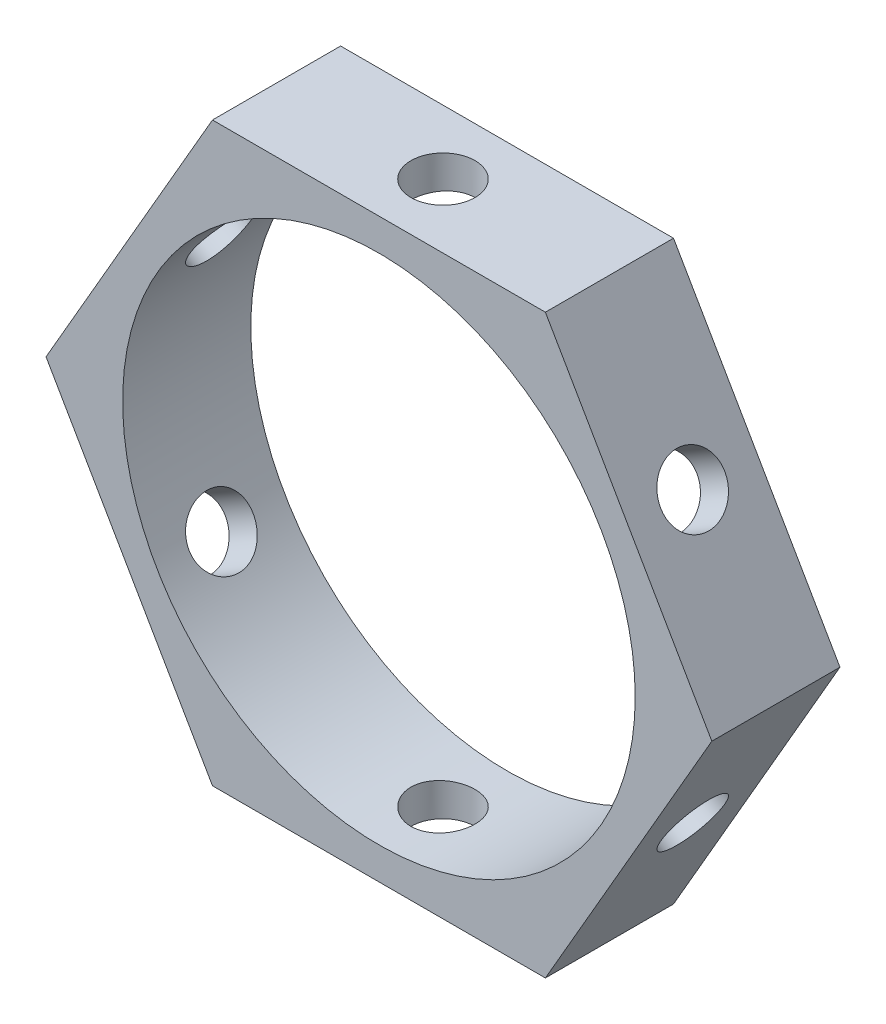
ISO-10303-21;
HEADER;
FILE_DESCRIPTION(('STEP AP214'),'2;1');
FILE_NAME('part.step','',(''),(''),'','','');
FILE_SCHEMA(('AUTOMOTIVE_DESIGN { 1 0 10303 214 1 1 1 1 }'));
ENDSEC;
DATA;
#1=APPLICATION_CONTEXT('core data for automotive mechanical design processes');
#2=APPLICATION_PROTOCOL_DEFINITION('international standard','automotive_design',2000,#1);
#3=PRODUCT_CONTEXT('',#1,'mechanical');
#4=PRODUCT('Part','Part','',(#3));
#5=PRODUCT_RELATED_PRODUCT_CATEGORY('part','',(#4));
#6=PRODUCT_DEFINITION_FORMATION('','',#4);
#7=PRODUCT_DEFINITION_CONTEXT('part definition',#1,'design');
#8=PRODUCT_DEFINITION('design','',#6,#7);
#9=PRODUCT_DEFINITION_SHAPE('','',#8);
#10=(LENGTH_UNIT() NAMED_UNIT(*) SI_UNIT(.MILLI.,.METRE.));
#11=(NAMED_UNIT(*) PLANE_ANGLE_UNIT() SI_UNIT($,.RADIAN.));
#12=(NAMED_UNIT(*) SI_UNIT($,.STERADIAN.) SOLID_ANGLE_UNIT());
#13=UNCERTAINTY_MEASURE_WITH_UNIT(LENGTH_MEASURE(1.E-05),#10,'distance_accuracy_value','');
#14=(GEOMETRIC_REPRESENTATION_CONTEXT(3) GLOBAL_UNCERTAINTY_ASSIGNED_CONTEXT((#13)) GLOBAL_UNIT_ASSIGNED_CONTEXT((#10,
#11,#12)) REPRESENTATION_CONTEXT('',''));
#15=CARTESIAN_POINT('',(0.,0.,0.));
#16=DIRECTION('',(0.,0.,1.));
#17=DIRECTION('',(1.,0.,0.));
#18=AXIS2_PLACEMENT_3D('',#15,#16,#17);
#19=CARTESIAN_POINT('',(12.9903810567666,-22.5,10.));
#20=DIRECTION('',(0.,0.,-1.));
#21=DIRECTION('',(-1.,0.,0.));
#22=AXIS2_PLACEMENT_3D('',#19,#20,#21);
#23=PLANE('',#22);
#24=DIRECTION('',(0.5,0.866025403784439,0.));
#25=VECTOR('',#24,1.);
#26=CARTESIAN_POINT('',(12.9903810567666,-22.5,10.));
#27=LINE('',#26,#25);
#28=CARTESIAN_POINT('',(12.9903810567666,-22.5,10.));
#29=VERTEX_POINT('',#28);
#30=CARTESIAN_POINT('',(25.9807621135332,0.,10.));
#31=VERTEX_POINT('',#30);
#32=EDGE_CURVE('E442',#29,#31,#27,.T.);
#33=ORIENTED_EDGE('',*,*,#32,.T.);
#34=DIRECTION('',(-0.5,0.866025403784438,0.));
#35=VECTOR('',#34,1.);
#36=CARTESIAN_POINT('',(25.9807621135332,0.,10.));
#37=LINE('',#36,#35);
#38=CARTESIAN_POINT('',(12.9903810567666,22.5,10.));
#39=VERTEX_POINT('',#38);
#40=EDGE_CURVE('E423',#31,#39,#37,.T.);
#41=ORIENTED_EDGE('',*,*,#40,.T.);
#42=DIRECTION('',(-1.,0.,0.));
#43=VECTOR('',#42,1.);
#44=CARTESIAN_POINT('',(12.9903810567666,22.5,10.));
#45=LINE('',#44,#43);
#46=CARTESIAN_POINT('',(-12.9903810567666,22.5,10.));
#47=VERTEX_POINT('',#46);
#48=EDGE_CURVE('E445',#39,#47,#45,.T.);
#49=ORIENTED_EDGE('',*,*,#48,.T.);
#50=DIRECTION('',(-0.5,-0.866025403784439,0.));
#51=VECTOR('',#50,1.);
#52=CARTESIAN_POINT('',(-12.9903810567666,22.5,10.));
#53=LINE('',#52,#51);
#54=CARTESIAN_POINT('',(-25.9807621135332,0.,10.));
#55=VERTEX_POINT('',#54);
#56=EDGE_CURVE('E447',#47,#55,#53,.T.);
#57=ORIENTED_EDGE('',*,*,#56,.T.);
#58=DIRECTION('',(0.5,-0.866025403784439,0.));
#59=VECTOR('',#58,1.);
#60=CARTESIAN_POINT('',(-25.9807621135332,0.,10.));
#61=LINE('',#60,#59);
#62=CARTESIAN_POINT('',(-12.9903810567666,-22.5,10.));
#63=VERTEX_POINT('',#62);
#64=EDGE_CURVE('E376',#55,#63,#61,.T.);
#65=ORIENTED_EDGE('',*,*,#64,.T.);
#66=DIRECTION('',(1.,0.,0.));
#67=VECTOR('',#66,1.);
#68=CARTESIAN_POINT('',(-12.9903810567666,-22.5,10.));
#69=LINE('',#68,#67);
#70=EDGE_CURVE('E371',#63,#29,#69,.T.);
#71=ORIENTED_EDGE('',*,*,#70,.T.);
#72=EDGE_LOOP('',(#33,#41,#49,#57,#65,#71));
#73=FACE_BOUND('',#72,.T.);
#74=CARTESIAN_POINT('',(0.,0.,10.));
#75=DIRECTION('',(0.,0.,1.));
#76=DIRECTION('',(1.,0.,0.));
#77=AXIS2_PLACEMENT_3D('',#74,#75,#76);
#78=CIRCLE('',#77,20.);
#79=CARTESIAN_POINT('',(20.,0.,10.));
#80=VERTEX_POINT('',#79);
#81=EDGE_CURVE('E428',#80,#80,#78,.T.);
#82=ORIENTED_EDGE('',*,*,#81,.F.);
#83=EDGE_LOOP('',(#82));
#84=FACE_BOUND('',#83,.T.);
#85=ADVANCED_FACE('F350',(#73,#84),#23,.F.);
#86=CARTESIAN_POINT('',(12.9903810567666,-22.5,0.));
#87=DIRECTION('',(0.,0.,-1.));
#88=DIRECTION('',(-1.,0.,0.));
#89=AXIS2_PLACEMENT_3D('',#86,#87,#88);
#90=PLANE('',#89);
#91=DIRECTION('',(0.5,0.866025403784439,0.));
#92=VECTOR('',#91,1.);
#93=CARTESIAN_POINT('',(12.9903810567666,-22.5,0.));
#94=LINE('',#93,#92);
#95=CARTESIAN_POINT('',(12.9903810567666,-22.5,0.));
#96=VERTEX_POINT('',#95);
#97=CARTESIAN_POINT('',(25.9807621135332,0.,0.));
#98=VERTEX_POINT('',#97);
#99=EDGE_CURVE('E414',#96,#98,#94,.T.);
#100=ORIENTED_EDGE('',*,*,#99,.F.);
#101=DIRECTION('',(1.,0.,0.));
#102=VECTOR('',#101,1.);
#103=CARTESIAN_POINT('',(-12.9903810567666,-22.5,0.));
#104=LINE('',#103,#102);
#105=CARTESIAN_POINT('',(-12.9903810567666,-22.5,0.));
#106=VERTEX_POINT('',#105);
#107=EDGE_CURVE('E440',#106,#96,#104,.T.);
#108=ORIENTED_EDGE('',*,*,#107,.F.);
#109=DIRECTION('',(0.5,-0.866025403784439,0.));
#110=VECTOR('',#109,1.);
#111=CARTESIAN_POINT('',(-25.9807621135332,0.,0.));
#112=LINE('',#111,#110);
#113=CARTESIAN_POINT('',(-25.9807621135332,0.,0.));
#114=VERTEX_POINT('',#113);
#115=EDGE_CURVE('E438',#114,#106,#112,.T.);
#116=ORIENTED_EDGE('',*,*,#115,.F.);
#117=DIRECTION('',(-0.5,-0.866025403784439,0.));
#118=VECTOR('',#117,1.);
#119=CARTESIAN_POINT('',(-12.9903810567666,22.5,0.));
#120=LINE('',#119,#118);
#121=CARTESIAN_POINT('',(-12.9903810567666,22.5,0.));
#122=VERTEX_POINT('',#121);
#123=EDGE_CURVE('E436',#122,#114,#120,.T.);
#124=ORIENTED_EDGE('',*,*,#123,.F.);
#125=DIRECTION('',(-1.,0.,0.));
#126=VECTOR('',#125,1.);
#127=CARTESIAN_POINT('',(12.9903810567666,22.5,0.));
#128=LINE('',#127,#126);
#129=CARTESIAN_POINT('',(12.9903810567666,22.5,0.));
#130=VERTEX_POINT('',#129);
#131=EDGE_CURVE('E416',#130,#122,#128,.T.);
#132=ORIENTED_EDGE('',*,*,#131,.F.);
#133=DIRECTION('',(-0.5,0.866025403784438,0.));
#134=VECTOR('',#133,1.);
#135=CARTESIAN_POINT('',(25.9807621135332,0.,0.));
#136=LINE('',#135,#134);
#137=EDGE_CURVE('E409',#98,#130,#136,.T.);
#138=ORIENTED_EDGE('',*,*,#137,.F.);
#139=EDGE_LOOP('',(#100,#108,#116,#124,#132,#138));
#140=FACE_BOUND('',#139,.T.);
#141=CARTESIAN_POINT('',(0.,0.,0.));
#142=DIRECTION('',(0.,0.,1.));
#143=DIRECTION('',(1.,0.,0.));
#144=AXIS2_PLACEMENT_3D('',#141,#142,#143);
#145=CIRCLE('',#144,20.);
#146=CARTESIAN_POINT('',(20.,0.,0.));
#147=VERTEX_POINT('',#146);
#148=EDGE_CURVE('E431',#147,#147,#145,.T.);
#149=ORIENTED_EDGE('',*,*,#148,.T.);
#150=EDGE_LOOP('',(#149));
#151=FACE_BOUND('',#150,.T.);
#152=ADVANCED_FACE('F410',(#140,#151),#90,.T.);
#153=CARTESIAN_POINT('',(12.9903810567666,-22.5,10.));
#154=DIRECTION('',(-0.866025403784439,0.5,0.));
#155=DIRECTION('',(-0.5,-0.866025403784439,0.));
#156=AXIS2_PLACEMENT_3D('',#153,#154,#155);
#157=PLANE('',#156);
#158=CARTESIAN_POINT('',(19.4855715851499,-11.25,5.));
#159=DIRECTION('',(0.866025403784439,-0.5,0.));
#160=DIRECTION('',(0.5,0.866025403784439,0.));
#161=AXIS2_PLACEMENT_3D('',#158,#159,#160);
#162=CIRCLE('',#161,2.5);
#163=CARTESIAN_POINT('',(20.7355715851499,-9.08493649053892,5.));
#164=VERTEX_POINT('',#163);
#165=EDGE_CURVE('E503',#164,#164,#162,.T.);
#166=ORIENTED_EDGE('',*,*,#165,.F.);
#167=EDGE_LOOP('',(#166));
#168=FACE_BOUND('',#167,.T.);
#169=ORIENTED_EDGE('',*,*,#99,.T.);
#170=DIRECTION('',(0.,0.,-1.));
#171=VECTOR('',#170,1.);
#172=CARTESIAN_POINT('',(25.9807621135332,0.,10.));
#173=LINE('',#172,#171);
#174=EDGE_CURVE('E11',#31,#98,#173,.T.);
#175=ORIENTED_EDGE('',*,*,#174,.F.);
#176=ORIENTED_EDGE('',*,*,#32,.F.);
#177=DIRECTION('',(0.,0.,-1.));
#178=VECTOR('',#177,1.);
#179=CARTESIAN_POINT('',(12.9903810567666,-22.5,10.));
#180=LINE('',#179,#178);
#181=EDGE_CURVE('E427',#29,#96,#180,.T.);
#182=ORIENTED_EDGE('',*,*,#181,.T.);
#183=EDGE_LOOP('',(#169,#175,#176,#182));
#184=FACE_BOUND('',#183,.T.);
#185=ADVANCED_FACE('F352',(#168,#184),#157,.F.);
#186=CARTESIAN_POINT('',(25.9807621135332,0.,10.));
#187=DIRECTION('',(-0.866025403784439,-0.5,0.));
#188=DIRECTION('',(0.5,-0.866025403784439,0.));
#189=AXIS2_PLACEMENT_3D('',#186,#187,#188);
#190=PLANE('',#189);
#191=CARTESIAN_POINT('',(19.4855715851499,11.25,5.));
#192=DIRECTION('',(0.866025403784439,0.5,0.));
#193=DIRECTION('',(-0.5,0.866025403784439,0.));
#194=AXIS2_PLACEMENT_3D('',#191,#192,#193);
#195=CIRCLE('',#194,2.5);
#196=CARTESIAN_POINT('',(18.2355715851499,13.4150635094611,5.));
#197=VERTEX_POINT('',#196);
#198=EDGE_CURVE('E469',#197,#197,#195,.T.);
#199=ORIENTED_EDGE('',*,*,#198,.F.);
#200=EDGE_LOOP('',(#199));
#201=FACE_BOUND('',#200,.T.);
#202=ORIENTED_EDGE('',*,*,#137,.T.);
#203=DIRECTION('',(0.,0.,-1.));
#204=VECTOR('',#203,1.);
#205=CARTESIAN_POINT('',(12.9903810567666,22.5,10.));
#206=LINE('',#205,#204);
#207=EDGE_CURVE('E363',#39,#130,#206,.T.);
#208=ORIENTED_EDGE('',*,*,#207,.F.);
#209=ORIENTED_EDGE('',*,*,#40,.F.);
#210=ORIENTED_EDGE('',*,*,#174,.T.);
#211=EDGE_LOOP('',(#202,#208,#209,#210));
#212=FACE_BOUND('',#211,.T.);
#213=ADVANCED_FACE('F422',(#201,#212),#190,.F.);
#214=CARTESIAN_POINT('',(12.9903810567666,22.5,10.));
#215=DIRECTION('',(0.,-1.,0.));
#216=DIRECTION('',(1.,0.,0.));
#217=AXIS2_PLACEMENT_3D('',#214,#215,#216);
#218=PLANE('',#217);
#219=CARTESIAN_POINT('',(0.,22.5,5.));
#220=DIRECTION('',(0.,-1.,0.));
#221=DIRECTION('',(0.,0.,-1.));
#222=AXIS2_PLACEMENT_3D('',#219,#220,#221);
#223=CIRCLE('',#222,2.5);
#224=CARTESIAN_POINT('',(0.,22.5,2.5));
#225=VERTEX_POINT('',#224);
#226=EDGE_CURVE('E518',#225,#225,#223,.T.);
#227=ORIENTED_EDGE('',*,*,#226,.T.);
#228=EDGE_LOOP('',(#227));
#229=FACE_BOUND('',#228,.T.);
#230=ORIENTED_EDGE('',*,*,#131,.T.);
#231=DIRECTION('',(0.,0.,-1.));
#232=VECTOR('',#231,1.);
#233=CARTESIAN_POINT('',(-12.9903810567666,22.5,10.));
#234=LINE('',#233,#232);
#235=EDGE_CURVE('E458',#47,#122,#234,.T.);
#236=ORIENTED_EDGE('',*,*,#235,.F.);
#237=ORIENTED_EDGE('',*,*,#48,.F.);
#238=ORIENTED_EDGE('',*,*,#207,.T.);
#239=EDGE_LOOP('',(#230,#236,#237,#238));
#240=FACE_BOUND('',#239,.T.);
#241=ADVANCED_FACE('F553',(#229,#240),#218,.F.);
#242=CARTESIAN_POINT('',(-12.9903810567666,22.5,10.));
#243=DIRECTION('',(0.866025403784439,-0.5,0.));
#244=DIRECTION('',(0.5,0.866025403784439,0.));
#245=AXIS2_PLACEMENT_3D('',#242,#243,#244);
#246=PLANE('',#245);
#247=CARTESIAN_POINT('',(-19.4855715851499,11.25,5.));
#248=DIRECTION('',(0.866025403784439,-0.5,0.));
#249=DIRECTION('',(0.5,0.866025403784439,0.));
#250=AXIS2_PLACEMENT_3D('',#247,#248,#249);
#251=CIRCLE('',#250,2.5);
#252=CARTESIAN_POINT('',(-18.2355715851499,13.4150635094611,5.));
#253=VERTEX_POINT('',#252);
#254=EDGE_CURVE('E507',#253,#253,#251,.T.);
#255=ORIENTED_EDGE('',*,*,#254,.T.);
#256=EDGE_LOOP('',(#255));
#257=FACE_BOUND('',#256,.T.);
#258=ORIENTED_EDGE('',*,*,#123,.T.);
#259=DIRECTION('',(0.,0.,-1.));
#260=VECTOR('',#259,1.);
#261=CARTESIAN_POINT('',(-25.9807621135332,0.,10.));
#262=LINE('',#261,#260);
#263=EDGE_CURVE('E455',#55,#114,#262,.T.);
#264=ORIENTED_EDGE('',*,*,#263,.F.);
#265=ORIENTED_EDGE('',*,*,#56,.F.);
#266=ORIENTED_EDGE('',*,*,#235,.T.);
#267=EDGE_LOOP('',(#258,#264,#265,#266));
#268=FACE_BOUND('',#267,.T.);
#269=ADVANCED_FACE('F550',(#257,#268),#246,.F.);
#270=CARTESIAN_POINT('',(-25.9807621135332,0.,10.));
#271=DIRECTION('',(0.866025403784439,0.5,0.));
#272=DIRECTION('',(-0.5,0.866025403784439,0.));
#273=AXIS2_PLACEMENT_3D('',#270,#271,#272);
#274=PLANE('',#273);
#275=CARTESIAN_POINT('',(-19.4855715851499,-11.25,5.));
#276=DIRECTION('',(0.866025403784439,0.5,0.));
#277=DIRECTION('',(-0.5,0.866025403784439,0.));
#278=AXIS2_PLACEMENT_3D('',#275,#276,#277);
#279=CIRCLE('',#278,2.5);
#280=CARTESIAN_POINT('',(-20.7355715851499,-9.08493649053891,5.));
#281=VERTEX_POINT('',#280);
#282=EDGE_CURVE('E523',#281,#281,#279,.T.);
#283=ORIENTED_EDGE('',*,*,#282,.T.);
#284=EDGE_LOOP('',(#283));
#285=FACE_BOUND('',#284,.T.);
#286=ORIENTED_EDGE('',*,*,#115,.T.);
#287=DIRECTION('',(0.,0.,-1.));
#288=VECTOR('',#287,1.);
#289=CARTESIAN_POINT('',(-12.9903810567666,-22.5,10.));
#290=LINE('',#289,#288);
#291=EDGE_CURVE('E452',#63,#106,#290,.T.);
#292=ORIENTED_EDGE('',*,*,#291,.F.);
#293=ORIENTED_EDGE('',*,*,#64,.F.);
#294=ORIENTED_EDGE('',*,*,#263,.T.);
#295=EDGE_LOOP('',(#286,#292,#293,#294));
#296=FACE_BOUND('',#295,.T.);
#297=ADVANCED_FACE('F536',(#285,#296),#274,.F.);
#298=CARTESIAN_POINT('',(-12.9903810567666,-22.5,10.));
#299=DIRECTION('',(0.,1.,0.));
#300=DIRECTION('',(0.,0.,1.));
#301=AXIS2_PLACEMENT_3D('',#298,#299,#300);
#302=PLANE('',#301);
#303=CARTESIAN_POINT('',(0.,-22.5,5.));
#304=DIRECTION('',(0.,-1.,0.));
#305=DIRECTION('',(0.,0.,-1.));
#306=AXIS2_PLACEMENT_3D('',#303,#304,#305);
#307=CIRCLE('',#306,2.5);
#308=CARTESIAN_POINT('',(0.,-22.5,2.5));
#309=VERTEX_POINT('',#308);
#310=EDGE_CURVE('E515',#309,#309,#307,.T.);
#311=ORIENTED_EDGE('',*,*,#310,.F.);
#312=EDGE_LOOP('',(#311));
#313=FACE_BOUND('',#312,.T.);
#314=ORIENTED_EDGE('',*,*,#107,.T.);
#315=ORIENTED_EDGE('',*,*,#181,.F.);
#316=ORIENTED_EDGE('',*,*,#70,.F.);
#317=ORIENTED_EDGE('',*,*,#291,.T.);
#318=EDGE_LOOP('',(#314,#315,#316,#317));
#319=FACE_BOUND('',#318,.T.);
#320=ADVANCED_FACE('F529',(#313,#319),#302,.F.);
#321=CARTESIAN_POINT('',(0.,0.,10.));
#322=DIRECTION('',(0.,0.,-1.));
#323=DIRECTION('',(-1.,0.,0.));
#324=AXIS2_PLACEMENT_3D('',#321,#322,#323);
#325=CYLINDRICAL_SURFACE('',#324,20.);
#326=CARTESIAN_POINT('',(-15.9346588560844,12.0866309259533,5.));
#327=CARTESIAN_POINT('',(-15.934663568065,12.0866267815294,5.13983628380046));
#328=CARTESIAN_POINT('',(-15.9418388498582,12.0771830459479,5.2797599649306));
#329=CARTESIAN_POINT('',(-15.9702418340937,12.0395975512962,5.55571322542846));
#330=CARTESIAN_POINT('',(-15.9914842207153,12.0114362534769,5.69173858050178));
#331=CARTESIAN_POINT('',(-16.0470674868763,11.9370752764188,5.95585988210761));
#332=CARTESIAN_POINT('',(-16.0813994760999,11.8908878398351,6.0839611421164));
#333=CARTESIAN_POINT('',(-16.1616850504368,11.7815328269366,6.32872845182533));
#334=CARTESIAN_POINT('',(-16.2076366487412,11.7183681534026,6.44539645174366));
#335=CARTESIAN_POINT('',(-16.3095349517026,11.5761280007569,6.66466224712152));
#336=CARTESIAN_POINT('',(-16.365530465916,11.4969745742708,6.76718680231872));
#337=CARTESIAN_POINT('',(-16.4851516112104,11.3247844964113,6.95462276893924));
#338=CARTESIAN_POINT('',(-16.5487776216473,11.2317471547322,7.03953330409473));
#339=CARTESIAN_POINT('',(-16.6814864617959,11.0336867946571,7.18959357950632));
#340=CARTESIAN_POINT('',(-16.7505866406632,10.9286251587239,7.25467704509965));
#341=CARTESIAN_POINT('',(-16.8915721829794,10.7094234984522,7.36281119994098));
#342=CARTESIAN_POINT('',(-16.9634574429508,10.5952838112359,7.40586270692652));
#343=CARTESIAN_POINT('',(-17.1071995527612,10.3615845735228,7.46849206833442));
#344=CARTESIAN_POINT('',(-17.1790545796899,10.2420565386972,7.48819167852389));
#345=CARTESIAN_POINT('',(-17.3208714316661,10.0003520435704,7.50393538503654));
#346=CARTESIAN_POINT('',(-17.3908333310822,9.87817568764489,7.49998041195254));
#347=CARTESIAN_POINT('',(-17.5265101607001,9.63538687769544,7.46862479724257));
#348=CARTESIAN_POINT('',(-17.5922466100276,9.51476950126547,7.44135510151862));
#349=CARTESIAN_POINT('',(-17.7182855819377,9.27795026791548,7.36434882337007));
#350=CARTESIAN_POINT('',(-17.7785880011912,9.16174849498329,7.31461181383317));
#351=CARTESIAN_POINT('',(-17.8926531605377,8.93694079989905,7.19394350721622));
#352=CARTESIAN_POINT('',(-17.9463978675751,8.828356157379,7.12295554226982));
#353=CARTESIAN_POINT('',(-18.0462325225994,8.62244776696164,6.96184163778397));
#354=CARTESIAN_POINT('',(-18.0923221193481,8.52512453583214,6.87171482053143));
#355=CARTESIAN_POINT('',(-18.1764944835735,8.34416540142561,6.67414818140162));
#356=CARTESIAN_POINT('',(-18.2145203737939,8.26062759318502,6.56659424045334));
#357=CARTESIAN_POINT('',(-18.2817417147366,8.11077593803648,6.33761844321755));
#358=CARTESIAN_POINT('',(-18.3109371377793,8.04446214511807,6.21619654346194));
#359=CARTESIAN_POINT('',(-18.3602505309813,7.93126929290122,5.96283050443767));
#360=CARTESIAN_POINT('',(-18.3803646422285,7.88439849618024,5.8308819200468));
#361=CARTESIAN_POINT('',(-18.4113494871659,7.81177210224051,5.56026054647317));
#362=CARTESIAN_POINT('',(-18.4222206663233,7.78601548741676,5.42158808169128));
#363=CARTESIAN_POINT('',(-18.4346099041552,7.75663680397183,5.14245681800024));
#364=CARTESIAN_POINT('',(-18.4361905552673,7.75286660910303,5.00201637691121));
#365=CARTESIAN_POINT('',(-18.4301568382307,7.76719878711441,4.72245807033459));
#366=CARTESIAN_POINT('',(-18.422542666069,7.78530069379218,4.58334017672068));
#367=CARTESIAN_POINT('',(-18.3982075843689,7.84263426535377,4.31085423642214));
#368=CARTESIAN_POINT('',(-18.3815174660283,7.88179448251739,4.1774683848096));
#369=CARTESIAN_POINT('',(-18.339163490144,7.97984446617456,3.91967584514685));
#370=CARTESIAN_POINT('',(-18.3134993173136,8.03873492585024,3.79526947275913));
#371=CARTESIAN_POINT('',(-18.2532437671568,8.17463301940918,3.55824535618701));
#372=CARTESIAN_POINT('',(-18.2186059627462,8.25173468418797,3.44569333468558));
#373=CARTESIAN_POINT('',(-18.1408174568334,8.42136726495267,3.23624344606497));
#374=CARTESIAN_POINT('',(-18.0976664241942,8.51389878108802,3.13934618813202));
#375=CARTESIAN_POINT('',(-18.0031312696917,8.71202371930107,2.9633958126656));
#376=CARTESIAN_POINT('',(-17.9517016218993,8.81768858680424,2.88444755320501));
#377=CARTESIAN_POINT('',(-17.8416216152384,9.03834713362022,2.74736178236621));
#378=CARTESIAN_POINT('',(-17.7829714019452,9.15334062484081,2.68922385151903));
#379=CARTESIAN_POINT('',(-17.6597857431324,9.38879965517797,2.59558221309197));
#380=CARTESIAN_POINT('',(-17.5952665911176,9.50924960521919,2.56001790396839));
#381=CARTESIAN_POINT('',(-17.4617366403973,9.75228004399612,2.51233591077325));
#382=CARTESIAN_POINT('',(-17.392726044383,9.87486043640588,2.50021716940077));
#383=CARTESIAN_POINT('',(-17.2525722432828,10.1177208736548,2.49979007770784));
#384=CARTESIAN_POINT('',(-17.1814467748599,10.2380109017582,2.51132003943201));
#385=CARTESIAN_POINT('',(-17.0387467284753,10.4737817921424,2.55752061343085));
#386=CARTESIAN_POINT('',(-16.9671721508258,10.5892626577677,2.59219120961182));
#387=CARTESIAN_POINT('',(-16.8259231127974,10.8122959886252,2.68363811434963));
#388=CARTESIAN_POINT('',(-16.7562479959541,10.919851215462,2.74040667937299));
#389=CARTESIAN_POINT('',(-16.621177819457,11.1243644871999,2.87442131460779));
#390=CARTESIAN_POINT('',(-16.5557828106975,11.2213224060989,2.95166762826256));
#391=CARTESIAN_POINT('',(-16.4312464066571,11.4029102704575,3.12504321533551));
#392=CARTESIAN_POINT('',(-16.372148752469,11.4874553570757,3.22129279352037));
#393=CARTESIAN_POINT('',(-16.2629798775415,11.6414957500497,3.42969294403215));
#394=CARTESIAN_POINT('',(-16.2129107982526,11.710987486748,3.54184727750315));
#395=CARTESIAN_POINT('',(-16.1236819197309,11.833539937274,3.779369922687));
#396=CARTESIAN_POINT('',(-16.084564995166,11.8865361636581,3.90478758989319));
#397=CARTESIAN_POINT('',(-16.01921313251,11.9744661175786,4.16485674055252));
#398=CARTESIAN_POINT('',(-15.9929641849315,12.0094194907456,4.29949799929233));
#399=CARTESIAN_POINT('',(-15.9607790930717,12.0521354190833,4.52902998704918));
#400=CARTESIAN_POINT('',(-15.9510042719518,12.0650561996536,4.62247295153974));
#401=CARTESIAN_POINT('',(-15.937942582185,12.0823053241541,4.81059724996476));
#402=CARTESIAN_POINT('',(-15.9346556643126,12.0866337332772,4.90527857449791));
#403=CARTESIAN_POINT('',(-15.9346588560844,12.0866309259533,5.));
#404=B_SPLINE_CURVE_WITH_KNOTS('',3,(#326,#327,#328,#329,#330,#331,#332,#333,#334,#335,#336,
#337,#338,#339,#340,#341,#342,#343,#344,#345,#346,#347,#348,#349,#350,#351,#352,#353,#354,#355,
#356,#357,#358,#359,#360,#361,#362,#363,#364,#365,#366,#367,#368,#369,#370,#371,#372,#373,#374,
#375,#376,#377,#378,#379,#380,#381,#382,#383,#384,#385,#386,#387,#388,#389,#390,#391,#392,#393,
#394,#395,#396,#397,#398,#399,#400,#401,#402,#403),.UNSPECIFIED.,.T.,.F.,(4,2,2,2,2,2,2,2,2,2,2,
2,2,2,2,2,2,2,2,2,2,2,2,2,2,2,2,2,2,2,2,2,2,2,2,2,2,2,4),(0.,0.419162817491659,
0.838763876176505,1.25808045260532,1.67732537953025,2.09866577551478,2.52002712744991,
2.94278186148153,3.36552090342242,3.7860459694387,4.20655449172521,4.62471664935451,
5.04288675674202,5.46218204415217,5.88149656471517,6.30367697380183,6.72585870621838,
7.14821966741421,7.57056027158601,7.99005217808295,8.40953514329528,8.82760376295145,
9.24568707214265,9.66597819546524,10.0862856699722,10.5089888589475,10.9316835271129,
11.3532385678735,11.7747745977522,12.1934381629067,12.612101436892,13.030618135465,
13.4491398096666,13.8704012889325,14.2917625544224,14.7147509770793,15.1372778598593,
15.4212098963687,15.7051397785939),.UNSPECIFIED.);
#405=CARTESIAN_POINT('',(-15.9346588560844,12.0866309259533,5.));
#406=VERTEX_POINT('',#405);
#407=EDGE_CURVE('E354',#406,#406,#404,.T.);
#408=ORIENTED_EDGE('',*,*,#407,.F.);
#409=EDGE_LOOP('',(#408));
#410=FACE_BOUND('',#409,.T.);
#411=CARTESIAN_POINT('',(18.4346588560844,-7.75650390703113,5.));
#412=CARTESIAN_POINT('',(18.4346576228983,-7.75651005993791,4.86016371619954));
#413=CARTESIAN_POINT('',(18.4300667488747,-7.76744590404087,4.7202400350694));
#414=CARTESIAN_POINT('',(18.4117182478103,-7.81083635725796,4.44428677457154));
#415=CARTESIAN_POINT('',(18.3979510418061,-7.84331345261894,4.30826141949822));
#416=CARTESIAN_POINT('',(18.361344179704,-7.92863046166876,4.04414011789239));
#417=CARTESIAN_POINT('',(18.3385106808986,-7.98145655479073,3.9160388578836));
#418=CARTESIAN_POINT('',(18.2839492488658,-8.10566340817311,3.67127154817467));
#419=CARTESIAN_POINT('',(18.2522228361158,-8.1770409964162,3.55460354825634));
#420=CARTESIAN_POINT('',(18.1799884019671,-8.33640759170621,3.33533775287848));
#421=CARTESIAN_POINT('',(18.1394372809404,-8.42447784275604,3.23281319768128));
#422=CARTESIAN_POINT('',(18.0501268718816,-8.61416783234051,3.04537723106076));
#423=CARTESIAN_POINT('',(18.0013671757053,-8.7157882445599,2.96046669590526));
#424=CARTESIAN_POINT('',(17.8961962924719,-8.9297476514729,2.81040642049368));
#425=CARTESIAN_POINT('',(17.8397603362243,-9.04212097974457,2.74532295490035));
#426=CARTESIAN_POINT('',(17.7204189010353,-9.27381887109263,2.63718880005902));
#427=CARTESIAN_POINT('',(17.6575136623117,-9.39314317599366,2.59413729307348));
#428=CARTESIAN_POINT('',(17.5269952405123,-9.63447711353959,2.53150793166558));
#429=CARTESIAN_POINT('',(17.4594084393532,-9.75646940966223,2.51180832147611));
#430=CARTESIAN_POINT('',(17.3209946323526,-10.0001386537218,2.49606461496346));
#431=CARTESIAN_POINT('',(17.2501677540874,-10.1218156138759,2.50001958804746));
#432=CARTESIAN_POINT('',(17.1077448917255,-10.3607096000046,2.53137520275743));
#433=CARTESIAN_POINT('',(17.0361554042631,-10.4779477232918,2.55864489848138));
#434=CARTESIAN_POINT('',(16.8940834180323,-10.7055102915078,2.63565117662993));
#435=CARTESIAN_POINT('',(16.823600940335,-10.8158346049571,2.68538818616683));
#436=CARTESIAN_POINT('',(16.6859443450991,-11.0270217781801,2.80605649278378));
#437=CARTESIAN_POINT('',(16.6187796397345,-11.1278583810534,2.87704445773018));
#438=CARTESIAN_POINT('',(16.4903750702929,-11.3172719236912,3.03815836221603));
#439=CARTESIAN_POINT('',(16.4291354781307,-11.4058483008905,3.12828517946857));
#440=CARTESIAN_POINT('',(16.3145064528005,-11.5692232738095,3.32585181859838));
#441=CARTESIAN_POINT('',(16.2611735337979,-11.6439235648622,3.43340575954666));
#442=CARTESIAN_POINT('',(16.1650088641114,-11.7770647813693,3.66238155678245));
#443=CARTESIAN_POINT('',(16.1221771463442,-11.8355056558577,3.78380345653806));
#444=CARTESIAN_POINT('',(16.0488059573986,-11.9348087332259,4.03716949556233));
#445=CARTESIAN_POINT('',(16.0182717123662,-11.975663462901,4.1691180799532));
#446=CARTESIAN_POINT('',(15.9708678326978,-12.038810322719,4.43973945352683));
#447=CARTESIAN_POINT('',(15.9539975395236,-12.0611033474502,4.57841191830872));
#448=CARTESIAN_POINT('',(15.9347494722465,-12.0865220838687,4.85754318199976));
#449=CARTESIAN_POINT('',(15.932274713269,-12.0897760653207,4.99798362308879));
#450=CARTESIAN_POINT('',(15.9416698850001,-12.0773846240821,5.27754192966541));
#451=CARTESIAN_POINT('',(15.9535395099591,-12.0617396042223,5.41665982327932));
#452=CARTESIAN_POINT('',(15.9910242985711,-12.0119980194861,5.68914576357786));
#453=CARTESIAN_POINT('',(16.0165929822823,-11.9779638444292,5.8225316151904));
#454=CARTESIAN_POINT('',(16.0803297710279,-11.8922592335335,6.08032415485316));
#455=CARTESIAN_POINT('',(16.1184983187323,-11.8405881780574,6.20473052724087));
#456=CARTESIAN_POINT('',(16.2060617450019,-11.7204562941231,6.44175464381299));
#457=CARTESIAN_POINT('',(16.255514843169,-11.6519082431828,6.55430666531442));
#458=CARTESIAN_POINT('',(16.3635267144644,-11.4997251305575,6.76375655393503));
#459=CARTESIAN_POINT('',(16.4220858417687,-11.4160894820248,6.86065381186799));
#460=CARTESIAN_POINT('',(16.5463994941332,-11.2351571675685,7.03660418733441));
#461=CARTESIAN_POINT('',(16.6121931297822,-11.1377853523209,7.11555244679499));
#462=CARTESIAN_POINT('',(16.7482490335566,-10.9321239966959,7.2526382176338));
#463=CARTESIAN_POINT('',(16.8185112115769,-10.8238346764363,7.31077614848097));
#464=CARTESIAN_POINT('',(16.9608318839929,-10.5994232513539,7.40441778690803));
#465=CARTESIAN_POINT('',(17.0328850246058,-10.4833230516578,7.43998209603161));
#466=CARTESIAN_POINT('',(17.1765905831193,-10.2461675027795,7.48766408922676));
#467=CARTESIAN_POINT('',(17.2482430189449,-10.125112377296,7.49978283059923));
#468=CARTESIAN_POINT('',(17.3884894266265,-9.88230540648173,7.50020992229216));
#469=CARTESIAN_POINT('',(17.4571009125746,-9.76056392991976,7.48867996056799));
#470=CARTESIAN_POINT('',(17.5899344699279,-9.51909661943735,7.44247938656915));
#471=CARTESIAN_POINT('',(17.6541565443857,-9.39937078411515,7.40780879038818));
#472=CARTESIAN_POINT('',(17.7766845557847,-9.16552886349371,7.31636188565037));
#473=CARTESIAN_POINT('',(17.8349925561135,-9.05141082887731,7.25959332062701));
#474=CARTESIAN_POINT('',(17.9445711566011,-8.83217998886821,7.12557868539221));
#475=CARTESIAN_POINT('',(17.9958416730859,-8.72706729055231,7.04833237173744));
#476=CARTESIAN_POINT('',(18.0908331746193,-8.52842166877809,6.87495678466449));
#477=CARTESIAN_POINT('',(18.1345025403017,-8.43496905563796,6.77870720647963));
#478=CARTESIAN_POINT('',(18.2133209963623,-8.26340584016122,6.57030705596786));
#479=CARTESIAN_POINT('',(18.2484680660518,-8.18529887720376,6.45815272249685));
#480=CARTESIAN_POINT('',(18.3099871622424,-8.04674817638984,6.22063007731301));
#481=CARTESIAN_POINT('',(18.3363247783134,-7.98637381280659,6.09521241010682));
#482=CARTESIAN_POINT('',(18.3797984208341,-7.88581246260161,5.83514325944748));
#483=CARTESIAN_POINT('',(18.3969444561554,-7.84560352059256,5.70050200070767));
#484=CARTESIAN_POINT('',(18.4178449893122,-7.79637244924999,5.47097001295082));
#485=CARTESIAN_POINT('',(18.4241473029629,-7.78144681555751,5.37752704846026));
#486=CARTESIAN_POINT('',(18.43255463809,-7.7615104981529,5.18940275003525));
#487=CARTESIAN_POINT('',(18.4346596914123,-7.75649973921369,5.09472142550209));
#488=CARTESIAN_POINT('',(18.4346588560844,-7.75650390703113,5.));
#489=B_SPLINE_CURVE_WITH_KNOTS('',3,(#411,#412,#413,#414,#415,#416,#417,#418,#419,#420,#421,
#422,#423,#424,#425,#426,#427,#428,#429,#430,#431,#432,#433,#434,#435,#436,#437,#438,#439,#440,
#441,#442,#443,#444,#445,#446,#447,#448,#449,#450,#451,#452,#453,#454,#455,#456,#457,#458,#459,
#460,#461,#462,#463,#464,#465,#466,#467,#468,#469,#470,#471,#472,#473,#474,#475,#476,#477,#478,
#479,#480,#481,#482,#483,#484,#485,#486,#487,#488),.UNSPECIFIED.,.T.,.F.,(4,2,2,2,2,2,2,2,2,2,2,
2,2,2,2,2,2,2,2,2,2,2,2,2,2,2,2,2,2,2,2,2,2,2,2,2,2,2,4),(0.,0.419162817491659,
0.838763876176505,1.25808045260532,1.67732537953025,2.09866577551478,2.52002712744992,
2.94278186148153,3.36552090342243,3.7860459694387,4.20655449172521,4.62471664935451,
5.04288675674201,5.46218204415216,5.88149656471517,6.30367697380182,6.72585870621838,
7.14821966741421,7.57056027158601,7.99005217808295,8.40953514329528,8.82760376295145,
9.24568707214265,9.66597819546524,10.0862856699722,10.5089888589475,10.9316835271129,
11.3532385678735,11.7747745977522,12.1934381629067,12.612101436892,13.030618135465,
13.4491398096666,13.8704012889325,14.2917625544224,14.7147509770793,15.1372778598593,
15.4212098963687,15.7051397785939),.UNSPECIFIED.);
#490=CARTESIAN_POINT('',(18.4346588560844,-7.75650390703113,5.));
#491=VERTEX_POINT('',#490);
#492=EDGE_CURVE('E499',#491,#491,#489,.T.);
#493=ORIENTED_EDGE('',*,*,#492,.F.);
#494=EDGE_LOOP('',(#493));
#495=FACE_BOUND('',#494,.T.);
#496=CARTESIAN_POINT('',(0.,20.,2.5));
#497=CARTESIAN_POINT('',(0.139841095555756,19.9999980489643,2.50000594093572));
#498=CARTESIAN_POINT('',(0.279769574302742,19.998517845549,2.51177287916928));
#499=CARTESIAN_POINT('',(0.555732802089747,19.9927554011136,2.55852775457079));
#500=CARTESIAN_POINT('',(0.69176333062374,19.9884702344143,2.59353993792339));
#501=CARTESIAN_POINT('',(0.955895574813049,19.9775806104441,2.68573764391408));
#502=CARTESIAN_POINT('',(1.08400256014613,19.9709777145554,2.74290824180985));
#503=CARTESIAN_POINT('',(1.32877947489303,19.956187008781,2.87776728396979));
#504=CARTESIAN_POINT('',(1.44545136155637,19.9479994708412,2.95545220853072));
#505=CARTESIAN_POINT('',(1.66471281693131,19.9309032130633,3.12959194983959));
#506=CARTESIAN_POINT('',(1.76723036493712,19.9219911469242,3.22613712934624));
#507=CARTESIAN_POINT('',(1.95465279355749,19.9044772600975,3.43506282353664));
#508=CARTESIAN_POINT('',(2.03955677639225,19.8958754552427,3.54744414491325));
#509=CARTESIAN_POINT('',(2.18961016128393,19.8799230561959,3.78531997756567));
#510=CARTESIAN_POINT('',(2.25469209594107,19.8725767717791,3.91085736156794));
#511=CARTESIAN_POINT('',(2.36282307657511,19.8600112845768,4.17118705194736));
#512=CARTESIAN_POINT('',(2.40587295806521,19.8547920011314,4.30597900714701));
#513=CARTESIAN_POINT('',(2.46849898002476,19.8471033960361,4.58024419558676));
#514=CARTESIAN_POINT('',(2.4881967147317,19.8446198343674,4.71968925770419));
#515=CARTESIAN_POINT('',(2.50393554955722,19.8426402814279,4.99992626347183));
#516=CARTESIAN_POINT('',(2.49997760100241,19.8431441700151,5.14071815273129));
#517=CARTESIAN_POINT('',(2.4686172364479,19.8470695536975,5.41880482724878));
#518=CARTESIAN_POINT('',(2.44134876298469,19.8504743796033,5.55611498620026));
#519=CARTESIAN_POINT('',(2.36435038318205,19.8597919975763,5.82419502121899));
#520=CARTESIAN_POINT('',(2.3146200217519,19.8657048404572,5.95496476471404));
#521=CARTESIAN_POINT('',(2.19396555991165,19.8793911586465,6.20666799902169));
#522=CARTESIAN_POINT('',(2.12298325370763,19.8871697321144,6.32757330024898));
#523=CARTESIAN_POINT('',(1.96188146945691,19.903707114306,6.55580669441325));
#524=CARTESIAN_POINT('',(1.87176111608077,19.9124659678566,6.66313416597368));
#525=CARTESIAN_POINT('',(1.67419911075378,19.9300510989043,6.86194271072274));
#526=CARTESIAN_POINT('',(1.56664200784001,19.9388774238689,6.95330909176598));
#527=CARTESIAN_POINT('',(1.33765716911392,19.9555463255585,7.11670888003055));
#528=CARTESIAN_POINT('',(1.21622940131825,19.9633889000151,7.188742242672));
#529=CARTESIAN_POINT('',(0.962861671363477,19.9772115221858,7.31143132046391));
#530=CARTESIAN_POINT('',(0.830918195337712,19.9831909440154,7.36207985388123));
#531=CARTESIAN_POINT('',(0.560307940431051,19.9926078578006,7.44047049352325));
#532=CARTESIAN_POINT('',(0.421641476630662,19.9960454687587,7.46821367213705));
#533=CARTESIAN_POINT('',(0.142513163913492,19.9999759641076,7.49985742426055));
#534=CARTESIAN_POINT('',(0.00206949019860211,20.0004883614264,7.50391599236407));
#535=CARTESIAN_POINT('',(-0.277496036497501,19.9985633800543,7.48849226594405));
#536=CARTESIAN_POINT('',(-0.416617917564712,19.9961260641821,7.46901047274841));
#537=CARTESIAN_POINT('',(-0.689124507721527,19.9885876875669,7.40719029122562));
#538=CARTESIAN_POINT('',(-0.822526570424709,19.9834954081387,7.36492723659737));
#539=CARTESIAN_POINT('',(-1.08034965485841,19.971217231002,7.25882254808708));
#540=CARTESIAN_POINT('',(-1.20477037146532,19.9640312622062,7.19498018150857));
#541=CARTESIAN_POINT('',(-1.44180452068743,19.9483182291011,7.04714686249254));
#542=CARTESIAN_POINT('',(-1.55435375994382,19.9397844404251,6.96305371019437));
#543=CARTESIAN_POINT('',(-1.76379698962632,19.9223514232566,6.7772505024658));
#544=CARTESIAN_POINT('',(-1.86069035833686,19.913452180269,6.67553974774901));
#545=CARTESIAN_POINT('',(-2.03663195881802,19.8962310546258,6.45669258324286));
#546=CARTESIAN_POINT('',(-2.11557546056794,19.8879127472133,6.33947165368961));
#547=CARTESIAN_POINT('',(-2.25265288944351,19.8728541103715,6.09334175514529));
#548=CARTESIAN_POINT('',(-2.31078723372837,19.8661137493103,5.96443302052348));
#549=CARTESIAN_POINT('',(-2.40442657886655,19.85499850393,5.69892468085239));
#550=CARTESIAN_POINT('',(-2.43999062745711,19.8506174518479,5.56234616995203));
#551=CARTESIAN_POINT('',(-2.48766999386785,19.8446991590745,5.28509751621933));
#552=CARTESIAN_POINT('',(-2.49978640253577,19.8431617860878,5.144427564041));
#553=CARTESIAN_POINT('',(-2.50020653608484,19.8431087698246,4.86403107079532));
#554=CARTESIAN_POINT('',(-2.48867479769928,19.8445722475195,4.72430475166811));
#555=CARTESIAN_POINT('',(-2.44247440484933,19.850311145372,4.44879287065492));
#556=CARTESIAN_POINT('',(-2.40780574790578,19.8545865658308,4.31300730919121));
#557=CARTESIAN_POINT('',(-2.31636707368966,19.8654611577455,4.0492530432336));
#558=CARTESIAN_POINT('',(-2.25960498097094,19.8720594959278,3.92128155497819));
#559=CARTESIAN_POINT('',(-2.12560690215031,19.8868378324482,3.67665334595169));
#560=CARTESIAN_POINT('',(-2.04837065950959,19.8950178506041,3.55999676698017));
#561=CARTESIAN_POINT('',(-1.87500633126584,19.9121060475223,3.34046877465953));
#562=CARTESIAN_POINT('',(-1.77875562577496,19.9210187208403,3.23769453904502));
#563=CARTESIAN_POINT('',(-1.57035022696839,19.938528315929,3.04969317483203));
#564=CARTESIAN_POINT('',(-1.45819178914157,19.9471251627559,2.96447018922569));
#565=CARTESIAN_POINT('',(-1.22066562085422,19.9630705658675,2.81371464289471));
#566=CARTESIAN_POINT('',(-1.09524927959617,19.970414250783,2.74825819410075));
#567=CARTESIAN_POINT('',(-0.835182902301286,19.9829764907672,2.63942875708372));
#568=CARTESIAN_POINT('',(-0.700543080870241,19.9881973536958,2.59603177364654));
#569=CARTESIAN_POINT('',(-0.47100577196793,19.9946672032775,2.54294066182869));
#570=CARTESIAN_POINT('',(-0.377555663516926,19.9966572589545,2.52686105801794));
#571=CARTESIAN_POINT('',(-0.18941706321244,19.9993243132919,2.50538875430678));
#572=CARTESIAN_POINT('',(-0.0947285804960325,20.0000013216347,2.4999959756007));
#573=CARTESIAN_POINT('',(0.,20.,2.5));
#574=B_SPLINE_CURVE_WITH_KNOTS('',3,(#496,#497,#498,#499,#500,#501,#502,#503,#504,#505,#506,
#507,#508,#509,#510,#511,#512,#513,#514,#515,#516,#517,#518,#519,#520,#521,#522,#523,#524,#525,
#526,#527,#528,#529,#530,#531,#532,#533,#534,#535,#536,#537,#538,#539,#540,#541,#542,#543,#544,
#545,#546,#547,#548,#549,#550,#551,#552,#553,#554,#555,#556,#557,#558,#559,#560,#561,#562,#563,
#564,#565,#566,#567,#568,#569,#570,#571,#572,#573),.UNSPECIFIED.,.T.,.F.,(4,2,2,2,2,2,2,2,2,2,2,
2,2,2,2,2,2,2,2,2,2,2,2,2,2,2,2,2,2,2,2,2,2,2,2,2,2,2,4),(0.,0.419177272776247,
0.838792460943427,1.25812550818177,1.67738665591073,2.09870813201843,2.52005107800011,
2.94281250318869,3.36555789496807,3.78609225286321,4.20660969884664,4.62472696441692,
5.04285270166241,5.46213426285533,5.88143500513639,6.30363478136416,6.72583553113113,
7.14817795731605,7.5705006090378,7.99000279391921,8.40949604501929,8.82761053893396,
9.24573923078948,9.66602402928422,10.0863255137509,10.5090197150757,10.9317054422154,
11.3532807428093,11.7748364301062,12.1934690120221,12.6121016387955,13.0305842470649,
13.4490720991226,13.8703523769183,14.2917319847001,14.7147140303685,15.1372349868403,
15.4211884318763,15.7051397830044),.UNSPECIFIED.);
#575=CARTESIAN_POINT('',(0.,20.,2.5));
#576=VERTEX_POINT('',#575);
#577=EDGE_CURVE('E495',#576,#576,#574,.T.);
#578=ORIENTED_EDGE('',*,*,#577,.F.);
#579=EDGE_LOOP('',(#578));
#580=FACE_BOUND('',#579,.T.);
#581=CARTESIAN_POINT('',(0.,-20.,2.5));
#582=CARTESIAN_POINT('',(-0.139841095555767,-19.9999980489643,2.50000594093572));
#583=CARTESIAN_POINT('',(-0.279769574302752,-19.998517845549,2.51177287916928));
#584=CARTESIAN_POINT('',(-0.555732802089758,-19.9927554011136,2.55852775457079));
#585=CARTESIAN_POINT('',(-0.69176333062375,-19.9884702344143,2.59353993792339));
#586=CARTESIAN_POINT('',(-0.95589557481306,-19.9775806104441,2.68573764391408));
#587=CARTESIAN_POINT('',(-1.08400256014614,-19.9709777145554,2.74290824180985));
#588=CARTESIAN_POINT('',(-1.32877947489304,-19.956187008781,2.87776728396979));
#589=CARTESIAN_POINT('',(-1.44545136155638,-19.9479994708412,2.95545220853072));
#590=CARTESIAN_POINT('',(-1.66471281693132,-19.9309032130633,3.12959194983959));
#591=CARTESIAN_POINT('',(-1.76723036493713,-19.9219911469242,3.22613712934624));
#592=CARTESIAN_POINT('',(-1.9546527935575,-19.9044772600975,3.43506282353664));
#593=CARTESIAN_POINT('',(-2.03955677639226,-19.8958754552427,3.54744414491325));
#594=CARTESIAN_POINT('',(-2.18961016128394,-19.8799230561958,3.78531997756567));
#595=CARTESIAN_POINT('',(-2.25469209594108,-19.8725767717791,3.91085736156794));
#596=CARTESIAN_POINT('',(-2.36282307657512,-19.8600112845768,4.17118705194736));
#597=CARTESIAN_POINT('',(-2.40587295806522,-19.8547920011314,4.30597900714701));
#598=CARTESIAN_POINT('',(-2.46849898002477,-19.8471033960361,4.58024419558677));
#599=CARTESIAN_POINT('',(-2.48819671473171,-19.8446198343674,4.71968925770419));
#600=CARTESIAN_POINT('',(-2.50393554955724,-19.8426402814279,4.99992626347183));
#601=CARTESIAN_POINT('',(-2.49997760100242,-19.8431441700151,5.14071815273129));
#602=CARTESIAN_POINT('',(-2.46861723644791,-19.8470695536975,5.41880482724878));
#603=CARTESIAN_POINT('',(-2.4413487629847,-19.8504743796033,5.55611498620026));
#604=CARTESIAN_POINT('',(-2.36435038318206,-19.8597919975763,5.82419502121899));
#605=CARTESIAN_POINT('',(-2.31462002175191,-19.8657048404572,5.95496476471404));
#606=CARTESIAN_POINT('',(-2.19396555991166,-19.8793911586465,6.20666799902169));
#607=CARTESIAN_POINT('',(-2.12298325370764,-19.8871697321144,6.32757330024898));
#608=CARTESIAN_POINT('',(-1.96188146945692,-19.903707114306,6.55580669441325));
#609=CARTESIAN_POINT('',(-1.87176111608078,-19.9124659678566,6.66313416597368));
#610=CARTESIAN_POINT('',(-1.67419911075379,-19.9300510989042,6.86194271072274));
#611=CARTESIAN_POINT('',(-1.56664200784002,-19.9388774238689,6.95330909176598));
#612=CARTESIAN_POINT('',(-1.33765716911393,-19.9555463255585,7.11670888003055));
#613=CARTESIAN_POINT('',(-1.21622940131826,-19.9633889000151,7.188742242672));
#614=CARTESIAN_POINT('',(-0.962861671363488,-19.9772115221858,7.31143132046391));
#615=CARTESIAN_POINT('',(-0.830918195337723,-19.9831909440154,7.36207985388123));
#616=CARTESIAN_POINT('',(-0.560307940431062,-19.9926078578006,7.44047049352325));
#617=CARTESIAN_POINT('',(-0.421641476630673,-19.9960454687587,7.46821367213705));
#618=CARTESIAN_POINT('',(-0.142513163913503,-19.9999759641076,7.49985742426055));
#619=CARTESIAN_POINT('',(-0.00206949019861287,-20.0004883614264,7.50391599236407));
#620=CARTESIAN_POINT('',(0.27749603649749,-19.9985633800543,7.48849226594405));
#621=CARTESIAN_POINT('',(0.4166179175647,-19.9961260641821,7.46901047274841));
#622=CARTESIAN_POINT('',(0.689124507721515,-19.9885876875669,7.40719029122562));
#623=CARTESIAN_POINT('',(0.822526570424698,-19.9834954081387,7.36492723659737));
#624=CARTESIAN_POINT('',(1.0803496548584,-19.971217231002,7.25882254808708));
#625=CARTESIAN_POINT('',(1.20477037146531,-19.9640312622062,7.19498018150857));
#626=CARTESIAN_POINT('',(1.44180452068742,-19.9483182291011,7.04714686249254));
#627=CARTESIAN_POINT('',(1.55435375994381,-19.9397844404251,6.96305371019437));
#628=CARTESIAN_POINT('',(1.76379698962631,-19.9223514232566,6.7772505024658));
#629=CARTESIAN_POINT('',(1.86069035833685,-19.913452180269,6.67553974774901));
#630=CARTESIAN_POINT('',(2.03663195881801,-19.8962310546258,6.45669258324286));
#631=CARTESIAN_POINT('',(2.11557546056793,-19.8879127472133,6.33947165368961));
#632=CARTESIAN_POINT('',(2.2526528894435,-19.8728541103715,6.09334175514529));
#633=CARTESIAN_POINT('',(2.31078723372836,-19.8661137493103,5.96443302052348));
#634=CARTESIAN_POINT('',(2.40442657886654,-19.85499850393,5.69892468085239));
#635=CARTESIAN_POINT('',(2.4399906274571,-19.8506174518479,5.56234616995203));
#636=CARTESIAN_POINT('',(2.48766999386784,-19.8446991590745,5.28509751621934));
#637=CARTESIAN_POINT('',(2.49978640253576,-19.8431617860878,5.144427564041));
#638=CARTESIAN_POINT('',(2.50020653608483,-19.8431087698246,4.86403107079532));
#639=CARTESIAN_POINT('',(2.48867479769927,-19.8445722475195,4.72430475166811));
#640=CARTESIAN_POINT('',(2.44247440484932,-19.850311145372,4.44879287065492));
#641=CARTESIAN_POINT('',(2.40780574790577,-19.8545865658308,4.31300730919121));
#642=CARTESIAN_POINT('',(2.31636707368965,-19.8654611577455,4.0492530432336));
#643=CARTESIAN_POINT('',(2.25960498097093,-19.8720594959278,3.92128155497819));
#644=CARTESIAN_POINT('',(2.12560690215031,-19.8868378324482,3.67665334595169));
#645=CARTESIAN_POINT('',(2.04837065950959,-19.8950178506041,3.55999676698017));
#646=CARTESIAN_POINT('',(1.87500633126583,-19.9121060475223,3.34046877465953));
#647=CARTESIAN_POINT('',(1.77875562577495,-19.9210187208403,3.23769453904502));
#648=CARTESIAN_POINT('',(1.57035022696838,-19.938528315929,3.04969317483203));
#649=CARTESIAN_POINT('',(1.45819178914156,-19.9471251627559,2.96447018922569));
#650=CARTESIAN_POINT('',(1.22066562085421,-19.9630705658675,2.81371464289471));
#651=CARTESIAN_POINT('',(1.09524927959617,-19.970414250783,2.74825819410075));
#652=CARTESIAN_POINT('',(0.835182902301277,-19.9829764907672,2.63942875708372));
#653=CARTESIAN_POINT('',(0.700543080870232,-19.9881973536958,2.59603177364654));
#654=CARTESIAN_POINT('',(0.471005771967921,-19.9946672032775,2.54294066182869));
#655=CARTESIAN_POINT('',(0.377555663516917,-19.9966572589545,2.52686105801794));
#656=CARTESIAN_POINT('',(0.189417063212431,-19.9993243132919,2.50538875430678));
#657=CARTESIAN_POINT('',(0.0947285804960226,-20.0000013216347,2.4999959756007));
#658=CARTESIAN_POINT('',(0.,-20.,2.5));
#659=B_SPLINE_CURVE_WITH_KNOTS('',3,(#581,#582,#583,#584,#585,#586,#587,#588,#589,#590,#591,
#592,#593,#594,#595,#596,#597,#598,#599,#600,#601,#602,#603,#604,#605,#606,#607,#608,#609,#610,
#611,#612,#613,#614,#615,#616,#617,#618,#619,#620,#621,#622,#623,#624,#625,#626,#627,#628,#629,
#630,#631,#632,#633,#634,#635,#636,#637,#638,#639,#640,#641,#642,#643,#644,#645,#646,#647,#648,
#649,#650,#651,#652,#653,#654,#655,#656,#657,#658),.UNSPECIFIED.,.T.,.F.,(4,2,2,2,2,2,2,2,2,2,2,
2,2,2,2,2,2,2,2,2,2,2,2,2,2,2,2,2,2,2,2,2,2,2,2,2,2,2,4),(0.,0.419177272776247,
0.838792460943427,1.25812550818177,1.67738665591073,2.09870813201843,2.52005107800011,
2.94281250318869,3.36555789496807,3.78609225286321,4.20660969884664,4.62472696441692,
5.04285270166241,5.46213426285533,5.88143500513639,6.30363478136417,6.72583553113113,
7.14817795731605,7.5705006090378,7.99000279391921,8.40949604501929,8.82761053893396,
9.24573923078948,9.66602402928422,10.0863255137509,10.5090197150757,10.9317054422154,
11.3532807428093,11.7748364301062,12.1934690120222,12.6121016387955,13.0305842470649,
13.4490720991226,13.8703523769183,14.2917319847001,14.7147140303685,15.1372349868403,
15.4211884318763,15.7051397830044),.UNSPECIFIED.);
#660=CARTESIAN_POINT('',(0.,-20.,2.5));
#661=VERTEX_POINT('',#660);
#662=EDGE_CURVE('E491',#661,#661,#659,.T.);
#663=ORIENTED_EDGE('',*,*,#662,.F.);
#664=EDGE_LOOP('',(#663));
#665=FACE_BOUND('',#664,.T.);
#666=CARTESIAN_POINT('',(-18.4346588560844,-7.75650390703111,5.));
#667=CARTESIAN_POINT('',(-18.4346576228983,-7.75651005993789,5.13983628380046));
#668=CARTESIAN_POINT('',(-18.4300667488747,-7.76744590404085,5.2797599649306));
#669=CARTESIAN_POINT('',(-18.4117182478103,-7.81083635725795,5.55571322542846));
#670=CARTESIAN_POINT('',(-18.3979510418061,-7.84331345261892,5.69173858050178));
#671=CARTESIAN_POINT('',(-18.361344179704,-7.92863046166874,5.95585988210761));
#672=CARTESIAN_POINT('',(-18.3385106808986,-7.98145655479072,6.0839611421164));
#673=CARTESIAN_POINT('',(-18.2839492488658,-8.1056634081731,6.32872845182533));
#674=CARTESIAN_POINT('',(-18.2522228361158,-8.17704099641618,6.44539645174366));
#675=CARTESIAN_POINT('',(-18.1799884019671,-8.3364075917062,6.66466224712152));
#676=CARTESIAN_POINT('',(-18.1394372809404,-8.42447784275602,6.76718680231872));
#677=CARTESIAN_POINT('',(-18.0501268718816,-8.61416783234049,6.95462276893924));
#678=CARTESIAN_POINT('',(-18.0013671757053,-8.71578824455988,7.03953330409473));
#679=CARTESIAN_POINT('',(-17.8961962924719,-8.92974765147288,7.18959357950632));
#680=CARTESIAN_POINT('',(-17.8397603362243,-9.04212097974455,7.25467704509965));
#681=CARTESIAN_POINT('',(-17.7204189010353,-9.27381887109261,7.36281119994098));
#682=CARTESIAN_POINT('',(-17.6575136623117,-9.39314317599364,7.40586270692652));
#683=CARTESIAN_POINT('',(-17.5269952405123,-9.63447711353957,7.46849206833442));
#684=CARTESIAN_POINT('',(-17.4594084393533,-9.75646940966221,7.48819167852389));
#685=CARTESIAN_POINT('',(-17.3209946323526,-10.0001386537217,7.50393538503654));
#686=CARTESIAN_POINT('',(-17.2501677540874,-10.1218156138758,7.49998041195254));
#687=CARTESIAN_POINT('',(-17.1077448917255,-10.3607096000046,7.46862479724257));
#688=CARTESIAN_POINT('',(-17.0361554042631,-10.4779477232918,7.44135510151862));
#689=CARTESIAN_POINT('',(-16.8940834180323,-10.7055102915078,7.36434882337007));
#690=CARTESIAN_POINT('',(-16.823600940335,-10.8158346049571,7.31461181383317));
#691=CARTESIAN_POINT('',(-16.6859443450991,-11.02702177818,7.19394350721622));
#692=CARTESIAN_POINT('',(-16.6187796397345,-11.1278583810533,7.12295554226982));
#693=CARTESIAN_POINT('',(-16.4903750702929,-11.3172719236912,6.96184163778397));
#694=CARTESIAN_POINT('',(-16.4291354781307,-11.4058483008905,6.87171482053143));
#695=CARTESIAN_POINT('',(-16.3145064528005,-11.5692232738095,6.67414818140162));
#696=CARTESIAN_POINT('',(-16.2611735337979,-11.6439235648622,6.56659424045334));
#697=CARTESIAN_POINT('',(-16.1650088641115,-11.7770647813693,6.33761844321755));
#698=CARTESIAN_POINT('',(-16.1221771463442,-11.8355056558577,6.21619654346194));
#699=CARTESIAN_POINT('',(-16.0488059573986,-11.9348087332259,5.96283050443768));
#700=CARTESIAN_POINT('',(-16.0182717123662,-11.975663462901,5.8308819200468));
#701=CARTESIAN_POINT('',(-15.9708678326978,-12.038810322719,5.56026054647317));
#702=CARTESIAN_POINT('',(-15.9539975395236,-12.0611033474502,5.42158808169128));
#703=CARTESIAN_POINT('',(-15.9347494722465,-12.0865220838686,5.14245681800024));
#704=CARTESIAN_POINT('',(-15.932274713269,-12.0897760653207,5.00201637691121));
#705=CARTESIAN_POINT('',(-15.9416698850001,-12.077384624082,4.72245807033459));
#706=CARTESIAN_POINT('',(-15.9535395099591,-12.0617396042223,4.58334017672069));
#707=CARTESIAN_POINT('',(-15.9910242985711,-12.0119980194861,4.31085423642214));
#708=CARTESIAN_POINT('',(-16.0165929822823,-11.9779638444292,4.1774683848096));
#709=CARTESIAN_POINT('',(-16.0803297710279,-11.8922592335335,3.91967584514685));
#710=CARTESIAN_POINT('',(-16.1184983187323,-11.8405881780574,3.79526947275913));
#711=CARTESIAN_POINT('',(-16.2060617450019,-11.7204562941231,3.55824535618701));
#712=CARTESIAN_POINT('',(-16.255514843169,-11.6519082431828,3.44569333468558));
#713=CARTESIAN_POINT('',(-16.3635267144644,-11.4997251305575,3.23624344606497));
#714=CARTESIAN_POINT('',(-16.4220858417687,-11.4160894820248,3.13934618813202));
#715=CARTESIAN_POINT('',(-16.5463994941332,-11.2351571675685,2.9633958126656));
#716=CARTESIAN_POINT('',(-16.6121931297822,-11.1377853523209,2.88444755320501));
#717=CARTESIAN_POINT('',(-16.7482490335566,-10.9321239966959,2.74736178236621));
#718=CARTESIAN_POINT('',(-16.8185112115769,-10.8238346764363,2.68922385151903));
#719=CARTESIAN_POINT('',(-16.9608318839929,-10.5994232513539,2.59558221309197));
#720=CARTESIAN_POINT('',(-17.0328850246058,-10.4833230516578,2.56001790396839));
#721=CARTESIAN_POINT('',(-17.1765905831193,-10.2461675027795,2.51233591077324));
#722=CARTESIAN_POINT('',(-17.2482430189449,-10.125112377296,2.50021716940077));
#723=CARTESIAN_POINT('',(-17.3884894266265,-9.88230540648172,2.49979007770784));
#724=CARTESIAN_POINT('',(-17.4571009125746,-9.76056392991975,2.51132003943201));
#725=CARTESIAN_POINT('',(-17.5899344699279,-9.51909661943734,2.55752061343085));
#726=CARTESIAN_POINT('',(-17.6541565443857,-9.39937078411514,2.59219120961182));
#727=CARTESIAN_POINT('',(-17.7766845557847,-9.1655288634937,2.68363811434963));
#728=CARTESIAN_POINT('',(-17.8349925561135,-9.05141082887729,2.74040667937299));
#729=CARTESIAN_POINT('',(-17.9445711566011,-8.8321799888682,2.87442131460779));
#730=CARTESIAN_POINT('',(-17.9958416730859,-8.7270672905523,2.95166762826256));
#731=CARTESIAN_POINT('',(-18.0908331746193,-8.52842166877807,3.1250432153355));
#732=CARTESIAN_POINT('',(-18.1345025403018,-8.43496905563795,3.22129279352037));
#733=CARTESIAN_POINT('',(-18.2133209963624,-8.2634058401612,3.42969294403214));
#734=CARTESIAN_POINT('',(-18.2484680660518,-8.18529887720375,3.54184727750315));
#735=CARTESIAN_POINT('',(-18.3099871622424,-8.04674817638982,3.779369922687));
#736=CARTESIAN_POINT('',(-18.3363247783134,-7.98637381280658,3.90478758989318));
#737=CARTESIAN_POINT('',(-18.3797984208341,-7.88581246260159,4.16485674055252));
#738=CARTESIAN_POINT('',(-18.3969444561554,-7.84560352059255,4.29949799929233));
#739=CARTESIAN_POINT('',(-18.4178449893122,-7.79637244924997,4.52902998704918));
#740=CARTESIAN_POINT('',(-18.4241473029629,-7.7814468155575,4.62247295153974));
#741=CARTESIAN_POINT('',(-18.43255463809,-7.76151049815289,4.81059724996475));
#742=CARTESIAN_POINT('',(-18.4346596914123,-7.75649973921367,4.90527857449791));
#743=CARTESIAN_POINT('',(-18.4346588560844,-7.75650390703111,5.));
#744=B_SPLINE_CURVE_WITH_KNOTS('',3,(#666,#667,#668,#669,#670,#671,#672,#673,#674,#675,#676,
#677,#678,#679,#680,#681,#682,#683,#684,#685,#686,#687,#688,#689,#690,#691,#692,#693,#694,#695,
#696,#697,#698,#699,#700,#701,#702,#703,#704,#705,#706,#707,#708,#709,#710,#711,#712,#713,#714,
#715,#716,#717,#718,#719,#720,#721,#722,#723,#724,#725,#726,#727,#728,#729,#730,#731,#732,#733,
#734,#735,#736,#737,#738,#739,#740,#741,#742,#743),.UNSPECIFIED.,.T.,.F.,(4,2,2,2,2,2,2,2,2,2,2,
2,2,2,2,2,2,2,2,2,2,2,2,2,2,2,2,2,2,2,2,2,2,2,2,2,2,2,4),(0.,0.419162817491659,
0.838763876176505,1.25808045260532,1.67732537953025,2.09866577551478,2.52002712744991,
2.94278186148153,3.36552090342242,3.7860459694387,4.20655449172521,4.62471664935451,
5.04288675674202,5.46218204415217,5.88149656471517,6.30367697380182,6.72585870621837,
7.14821966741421,7.57056027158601,7.99005217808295,8.40953514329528,8.82760376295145,
9.24568707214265,9.66597819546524,10.0862856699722,10.5089888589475,10.9316835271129,
11.3532385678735,11.7747745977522,12.1934381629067,12.612101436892,13.030618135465,
13.4491398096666,13.8704012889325,14.2917625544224,14.7147509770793,15.1372778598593,
15.4212098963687,15.7051397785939),.UNSPECIFIED.);
#745=CARTESIAN_POINT('',(-18.4346588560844,-7.75650390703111,5.));
#746=VERTEX_POINT('',#745);
#747=EDGE_CURVE('E468',#746,#746,#744,.T.);
#748=ORIENTED_EDGE('',*,*,#747,.F.);
#749=EDGE_LOOP('',(#748));
#750=FACE_BOUND('',#749,.T.);
#751=CARTESIAN_POINT('',(15.9346588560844,12.0866309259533,5.));
#752=CARTESIAN_POINT('',(15.9346635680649,12.0866267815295,4.86016371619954));
#753=CARTESIAN_POINT('',(15.9418388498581,12.077183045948,4.7202400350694));
#754=CARTESIAN_POINT('',(15.9702418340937,12.0395975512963,4.44428677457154));
#755=CARTESIAN_POINT('',(15.9914842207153,12.011436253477,4.30826141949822));
#756=CARTESIAN_POINT('',(16.0470674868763,11.9370752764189,4.04414011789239));
#757=CARTESIAN_POINT('',(16.0813994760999,11.8908878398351,3.91603885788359));
#758=CARTESIAN_POINT('',(16.1616850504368,11.7815328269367,3.67127154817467));
#759=CARTESIAN_POINT('',(16.2076366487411,11.7183681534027,3.55460354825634));
#760=CARTESIAN_POINT('',(16.3095349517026,11.5761280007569,3.33533775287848));
#761=CARTESIAN_POINT('',(16.365530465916,11.4969745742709,3.23281319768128));
#762=CARTESIAN_POINT('',(16.4851516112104,11.3247844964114,3.04537723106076));
#763=CARTESIAN_POINT('',(16.5487776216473,11.2317471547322,2.96046669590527));
#764=CARTESIAN_POINT('',(16.6814864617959,11.0336867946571,2.81040642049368));
#765=CARTESIAN_POINT('',(16.7505866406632,10.928625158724,2.74532295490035));
#766=CARTESIAN_POINT('',(16.8915721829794,10.7094234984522,2.63718880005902));
#767=CARTESIAN_POINT('',(16.9634574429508,10.5952838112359,2.59413729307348));
#768=CARTESIAN_POINT('',(17.1071995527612,10.3615845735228,2.53150793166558));
#769=CARTESIAN_POINT('',(17.1790545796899,10.2420565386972,2.51180832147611));
#770=CARTESIAN_POINT('',(17.3208714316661,10.0003520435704,2.49606461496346));
#771=CARTESIAN_POINT('',(17.3908333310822,9.87817568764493,2.50001958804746));
#772=CARTESIAN_POINT('',(17.5265101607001,9.63538687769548,2.53137520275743));
#773=CARTESIAN_POINT('',(17.5922466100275,9.51476950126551,2.55864489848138));
#774=CARTESIAN_POINT('',(17.7182855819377,9.27795026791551,2.63565117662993));
#775=CARTESIAN_POINT('',(17.7785880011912,9.16174849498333,2.68538818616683));
#776=CARTESIAN_POINT('',(17.8926531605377,8.93694079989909,2.80605649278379));
#777=CARTESIAN_POINT('',(17.946397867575,8.82835615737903,2.87704445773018));
#778=CARTESIAN_POINT('',(18.0462325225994,8.62244776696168,3.03815836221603));
#779=CARTESIAN_POINT('',(18.0923221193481,8.52512453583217,3.12828517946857));
#780=CARTESIAN_POINT('',(18.1764944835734,8.34416540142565,3.32585181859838));
#781=CARTESIAN_POINT('',(18.2145203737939,8.26062759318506,3.43340575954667));
#782=CARTESIAN_POINT('',(18.2817417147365,8.11077593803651,3.66238155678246));
#783=CARTESIAN_POINT('',(18.3109371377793,8.04446214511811,3.78380345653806));
#784=CARTESIAN_POINT('',(18.3602505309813,7.93126929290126,4.03716949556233));
#785=CARTESIAN_POINT('',(18.3803646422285,7.88439849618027,4.1691180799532));
#786=CARTESIAN_POINT('',(18.4113494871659,7.81177210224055,4.43973945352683));
#787=CARTESIAN_POINT('',(18.4222206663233,7.78601548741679,4.57841191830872));
#788=CARTESIAN_POINT('',(18.4346099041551,7.75663680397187,4.85754318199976));
#789=CARTESIAN_POINT('',(18.4361905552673,7.75286660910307,4.99798362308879));
#790=CARTESIAN_POINT('',(18.4301568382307,7.76719878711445,5.27754192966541));
#791=CARTESIAN_POINT('',(18.4225426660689,7.78530069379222,5.41665982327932));
#792=CARTESIAN_POINT('',(18.3982075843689,7.84263426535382,5.68914576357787));
#793=CARTESIAN_POINT('',(18.3815174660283,7.88179448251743,5.82253161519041));
#794=CARTESIAN_POINT('',(18.339163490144,7.9798444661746,6.08032415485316));
#795=CARTESIAN_POINT('',(18.3134993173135,8.03873492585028,6.20473052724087));
#796=CARTESIAN_POINT('',(18.2532437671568,8.17463301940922,6.44175464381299));
#797=CARTESIAN_POINT('',(18.2186059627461,8.25173468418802,6.55430666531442));
#798=CARTESIAN_POINT('',(18.1408174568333,8.42136726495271,6.76375655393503));
#799=CARTESIAN_POINT('',(18.0976664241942,8.51389878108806,6.86065381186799));
#800=CARTESIAN_POINT('',(18.0031312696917,8.71202371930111,7.03660418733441));
#801=CARTESIAN_POINT('',(17.9517016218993,8.81768858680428,7.11555244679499));
#802=CARTESIAN_POINT('',(17.8416216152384,9.03834713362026,7.25263821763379));
#803=CARTESIAN_POINT('',(17.7829714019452,9.15334062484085,7.31077614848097));
#804=CARTESIAN_POINT('',(17.6597857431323,9.38879965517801,7.40441778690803));
#805=CARTESIAN_POINT('',(17.5952665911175,9.50924960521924,7.43998209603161));
#806=CARTESIAN_POINT('',(17.4617366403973,9.75228004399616,7.48766408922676));
#807=CARTESIAN_POINT('',(17.392726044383,9.87486043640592,7.49978283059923));
#808=CARTESIAN_POINT('',(17.2525722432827,10.1177208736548,7.50020992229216));
#809=CARTESIAN_POINT('',(17.1814467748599,10.2380109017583,7.48867996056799));
#810=CARTESIAN_POINT('',(17.0387467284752,10.4737817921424,7.44247938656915));
#811=CARTESIAN_POINT('',(16.9671721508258,10.5892626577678,7.40780879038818));
#812=CARTESIAN_POINT('',(16.8259231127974,10.8122959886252,7.31636188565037));
#813=CARTESIAN_POINT('',(16.7562479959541,10.919851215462,7.25959332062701));
#814=CARTESIAN_POINT('',(16.621177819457,11.1243644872,7.12557868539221));
#815=CARTESIAN_POINT('',(16.5557828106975,11.2213224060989,7.04833237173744));
#816=CARTESIAN_POINT('',(16.4312464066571,11.4029102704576,6.8749567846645));
#817=CARTESIAN_POINT('',(16.372148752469,11.4874553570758,6.77870720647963));
#818=CARTESIAN_POINT('',(16.2629798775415,11.6414957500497,6.57030705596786));
#819=CARTESIAN_POINT('',(16.2129107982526,11.7109874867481,6.45815272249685));
#820=CARTESIAN_POINT('',(16.1236819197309,11.833539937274,6.220630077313));
#821=CARTESIAN_POINT('',(16.084564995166,11.8865361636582,6.09521241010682));
#822=CARTESIAN_POINT('',(16.01921313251,11.9744661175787,5.83514325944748));
#823=CARTESIAN_POINT('',(15.9929641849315,12.0094194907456,5.70050200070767));
#824=CARTESIAN_POINT('',(15.9607790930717,12.0521354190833,5.47097001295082));
#825=CARTESIAN_POINT('',(15.9510042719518,12.0650561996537,5.37752704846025));
#826=CARTESIAN_POINT('',(15.937942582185,12.0823053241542,5.18940275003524));
#827=CARTESIAN_POINT('',(15.9346556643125,12.0866337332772,5.09472142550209));
#828=CARTESIAN_POINT('',(15.9346588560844,12.0866309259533,5.));
#829=B_SPLINE_CURVE_WITH_KNOTS('',3,(#751,#752,#753,#754,#755,#756,#757,#758,#759,#760,#761,
#762,#763,#764,#765,#766,#767,#768,#769,#770,#771,#772,#773,#774,#775,#776,#777,#778,#779,#780,
#781,#782,#783,#784,#785,#786,#787,#788,#789,#790,#791,#792,#793,#794,#795,#796,#797,#798,#799,
#800,#801,#802,#803,#804,#805,#806,#807,#808,#809,#810,#811,#812,#813,#814,#815,#816,#817,#818,
#819,#820,#821,#822,#823,#824,#825,#826,#827,#828),.UNSPECIFIED.,.T.,.F.,(4,2,2,2,2,2,2,2,2,2,2,
2,2,2,2,2,2,2,2,2,2,2,2,2,2,2,2,2,2,2,2,2,2,2,2,2,2,2,4),(0.,0.419162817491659,
0.838763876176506,1.25808045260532,1.67732537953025,2.09866577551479,2.52002712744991,
2.94278186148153,3.36552090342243,3.7860459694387,4.20655449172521,4.62471664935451,
5.04288675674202,5.46218204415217,5.88149656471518,6.30367697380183,6.72585870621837,
7.14821966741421,7.57056027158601,7.99005217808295,8.40953514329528,8.82760376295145,
9.24568707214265,9.66597819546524,10.0862856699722,10.5089888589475,10.9316835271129,
11.3532385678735,11.7747745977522,12.1934381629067,12.612101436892,13.030618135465,
13.4491398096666,13.8704012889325,14.2917625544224,14.7147509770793,15.1372778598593,
15.4212098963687,15.7051397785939),.UNSPECIFIED.);
#830=CARTESIAN_POINT('',(15.9346588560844,12.0866309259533,5.));
#831=VERTEX_POINT('',#830);
#832=EDGE_CURVE('E462',#831,#831,#829,.T.);
#833=ORIENTED_EDGE('',*,*,#832,.F.);
#834=EDGE_LOOP('',(#833));
#835=FACE_BOUND('',#834,.T.);
#836=ORIENTED_EDGE('',*,*,#81,.T.);
#837=EDGE_LOOP('',(#836));
#838=FACE_BOUND('',#837,.T.);
#839=ORIENTED_EDGE('',*,*,#148,.F.);
#840=EDGE_LOOP('',(#839));
#841=FACE_BOUND('',#840,.T.);
#842=ADVANCED_FACE('F473',(#410,#495,#580,#665,#750,#835,#838,#841),#325,.F.);
#843=CARTESIAN_POINT('',(-29.2283573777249,-16.875,5.));
#844=DIRECTION('',(0.866025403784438,0.5,0.));
#845=DIRECTION('',(-0.5,0.866025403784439,0.));
#846=AXIS2_PLACEMENT_3D('',#843,#844,#845);
#847=CYLINDRICAL_SURFACE('',#846,2.5);
#848=ORIENTED_EDGE('',*,*,#832,.T.);
#849=EDGE_LOOP('',(#848));
#850=FACE_BOUND('',#849,.T.);
#851=ORIENTED_EDGE('',*,*,#198,.T.);
#852=EDGE_LOOP('',(#851));
#853=FACE_BOUND('',#852,.T.);
#854=ADVANCED_FACE('F476',(#850,#853),#847,.F.);
#855=ORIENTED_EDGE('',*,*,#747,.T.);
#856=EDGE_LOOP('',(#855));
#857=FACE_BOUND('',#856,.T.);
#858=ORIENTED_EDGE('',*,*,#282,.F.);
#859=EDGE_LOOP('',(#858));
#860=FACE_BOUND('',#859,.T.);
#861=ADVANCED_FACE('F480',(#857,#860),#847,.F.);
#862=CARTESIAN_POINT('',(0.,22.5,5.));
#863=DIRECTION('',(0.,-1.,0.));
#864=DIRECTION('',(0.,0.,-1.));
#865=AXIS2_PLACEMENT_3D('',#862,#863,#864);
#866=CYLINDRICAL_SURFACE('',#865,2.5);
#867=ORIENTED_EDGE('',*,*,#662,.T.);
#868=EDGE_LOOP('',(#867));
#869=FACE_BOUND('',#868,.T.);
#870=ORIENTED_EDGE('',*,*,#310,.T.);
#871=EDGE_LOOP('',(#870));
#872=FACE_BOUND('',#871,.T.);
#873=ADVANCED_FACE('F482',(#869,#872),#866,.F.);
#874=ORIENTED_EDGE('',*,*,#577,.T.);
#875=EDGE_LOOP('',(#874));
#876=FACE_BOUND('',#875,.T.);
#877=ORIENTED_EDGE('',*,*,#226,.F.);
#878=EDGE_LOOP('',(#877));
#879=FACE_BOUND('',#878,.T.);
#880=ADVANCED_FACE('F486',(#876,#879),#866,.F.);
#881=CARTESIAN_POINT('',(-29.2283573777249,16.875,5.));
#882=DIRECTION('',(0.866025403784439,-0.5,0.));
#883=DIRECTION('',(0.5,0.866025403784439,0.));
#884=AXIS2_PLACEMENT_3D('',#881,#882,#883);
#885=CYLINDRICAL_SURFACE('',#884,2.5);
#886=ORIENTED_EDGE('',*,*,#492,.T.);
#887=EDGE_LOOP('',(#886));
#888=FACE_BOUND('',#887,.T.);
#889=ORIENTED_EDGE('',*,*,#165,.T.);
#890=EDGE_LOOP('',(#889));
#891=FACE_BOUND('',#890,.T.);
#892=ADVANCED_FACE('F488',(#888,#891),#885,.F.);
#893=ORIENTED_EDGE('',*,*,#407,.T.);
#894=EDGE_LOOP('',(#893));
#895=FACE_BOUND('',#894,.T.);
#896=ORIENTED_EDGE('',*,*,#254,.F.);
#897=EDGE_LOOP('',(#896));
#898=FACE_BOUND('',#897,.T.);
#899=ADVANCED_FACE('F611',(#895,#898),#885,.F.);
#900=CLOSED_SHELL('',(#85,#152,#185,#213,#241,#269,#297,#320,#842,#854,#861,#873,#880,#892,#899));
#901=MANIFOLD_SOLID_BREP('B2',#900);
#902=ADVANCED_BREP_SHAPE_REPRESENTATION('',(#18,#901),#14);
#903=SHAPE_DEFINITION_REPRESENTATION(#9,#902);
ENDSEC;
END-ISO-10303-21;
